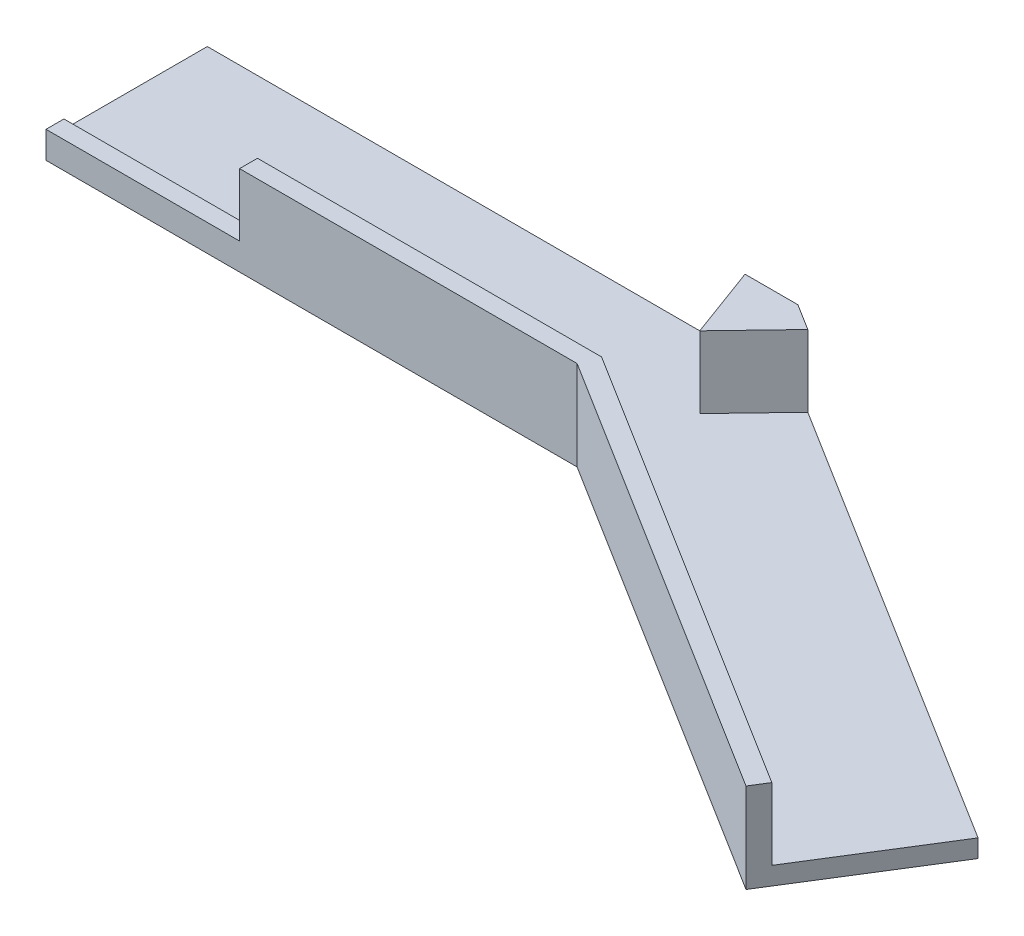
from build123d import *

# Parameters (mm, degrees)
BOSS_EXTRUDE1_DEPTH = 10
BOSS_EXTRUDE2_DEPTH = 2
SKETCH12_W          = 21.597271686
SKETCH12_H          = 2
CUT_EXTRUDE1_DEPTH  = 7
BOSS_EXTRUDE4_DEPTH = 8


with BuildPart() as part:
    # Sketch1 → Boss-Extrude1 (new body)
    with BuildSketch(Plane(origin=(0, 0, 0), x_dir=(1, 0, 0), z_dir=(0, 1, 0))):
        Polygon((0, -2), (59.26216105, -2), (109.519323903, -33.40416078), (110.625313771, -31.634207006), (60, 0), (0, 0), align=None)
    extrude(amount=BOSS_EXTRUDE1_DEPTH)

    # Sketch1_3 → Boss-Extrude2 (add)
    with BuildSketch(Plane(origin=(0, 0, 0), x_dir=(1, 0, 0), z_dir=(0, 1, 0))):
        Polygon((65.90271163, 16), (119.473232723, -17.474576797), (110.625313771, -31.634207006), (60, 0), (0, 0), (0, 16), align=None)
    extrude(amount=BOSS_EXTRUDE2_DEPTH)

    # Sketch12 → Cut-Extrude1 (cut)
    with BuildSketch(Plane(origin=(0, 10, 0), x_dir=(1, 0, 0), z_dir=(0, 1, 0))):
        with Locations((10.798635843, -1)):
            Rectangle(SKETCH12_W, SKETCH12_H)
    extrude(amount=-CUT_EXTRUDE1_DEPTH, mode=Mode.SUBTRACT)

    # Sketch13 → Boss-Extrude4 (add)
    with BuildSketch(Plane(origin=(0, 2, 0), x_dir=(1, 0, 0), z_dir=(0, 1, 0))):
        Polygon((62.951355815, 8), (68.847918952, 14.159630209), (65.90271163, 16), (60, 16), align=None)
    extrude(amount=BOSS_EXTRUDE4_DEPTH)


solid = part.part
